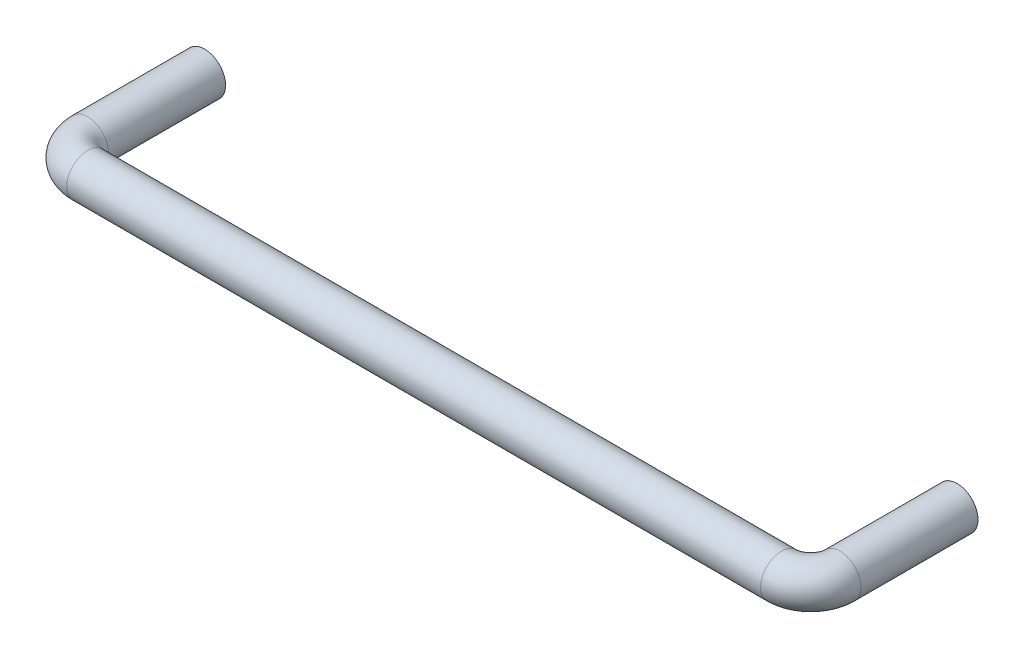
ISO-10303-21;
HEADER;
FILE_DESCRIPTION(('STEP AP214'),'2;1');
FILE_NAME('part.step','',(''),(''),'','','');
FILE_SCHEMA(('AUTOMOTIVE_DESIGN { 1 0 10303 214 1 1 1 1 }'));
ENDSEC;
DATA;
#1=APPLICATION_CONTEXT('core data for automotive mechanical design processes');
#2=APPLICATION_PROTOCOL_DEFINITION('international standard','automotive_design',2000,#1);
#3=PRODUCT_CONTEXT('',#1,'mechanical');
#4=PRODUCT('Part','Part','',(#3));
#5=PRODUCT_RELATED_PRODUCT_CATEGORY('part','',(#4));
#6=PRODUCT_DEFINITION_FORMATION('','',#4);
#7=PRODUCT_DEFINITION_CONTEXT('part definition',#1,'design');
#8=PRODUCT_DEFINITION('design','',#6,#7);
#9=PRODUCT_DEFINITION_SHAPE('','',#8);
#10=(LENGTH_UNIT() NAMED_UNIT(*) SI_UNIT(.MILLI.,.METRE.));
#11=(NAMED_UNIT(*) PLANE_ANGLE_UNIT() SI_UNIT($,.RADIAN.));
#12=(NAMED_UNIT(*) SI_UNIT($,.STERADIAN.) SOLID_ANGLE_UNIT());
#13=UNCERTAINTY_MEASURE_WITH_UNIT(LENGTH_MEASURE(1.E-05),#10,'distance_accuracy_value','');
#14=(GEOMETRIC_REPRESENTATION_CONTEXT(3) GLOBAL_UNCERTAINTY_ASSIGNED_CONTEXT((#13)) GLOBAL_UNIT_ASSIGNED_CONTEXT((#10,
#11,#12)) REPRESENTATION_CONTEXT('',''));
#15=CARTESIAN_POINT('',(0.,0.,0.));
#16=DIRECTION('',(0.,0.,1.));
#17=DIRECTION('',(1.,0.,0.));
#18=AXIS2_PLACEMENT_3D('',#15,#16,#17);
#19=CARTESIAN_POINT('',(-2.53,2.538705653,10.));
#20=DIRECTION('',(0.,0.,-1.));
#21=DIRECTION('',(1.,0.,0.));
#22=AXIS2_PLACEMENT_3D('',#19,#20,#21);
#23=PLANE('',#22);
#24=CARTESIAN_POINT('',(0.,0.,10.));
#25=DIRECTION('',(0.,0.,-1.));
#26=DIRECTION('',(0.,1.,0.));
#27=AXIS2_PLACEMENT_3D('',#24,#25,#26);
#28=CIRCLE('',#27,2.5);
#29=CARTESIAN_POINT('',(0.,2.5,10.));
#30=VERTEX_POINT('',#29);
#31=EDGE_CURVE('E33',#30,#30,#28,.T.);
#32=ORIENTED_EDGE('',*,*,#31,.T.);
#33=EDGE_LOOP('',(#32));
#34=FACE_BOUND('',#33,.T.);
#35=ADVANCED_FACE('F12',(#34),#23,.T.);
#36=CARTESIAN_POINT('',(0.,0.,10.));
#37=DIRECTION('',(0.,0.,-1.));
#38=DIRECTION('',(0.,1.,0.));
#39=AXIS2_PLACEMENT_3D('',#36,#37,#38);
#40=CYLINDRICAL_SURFACE('',#39,2.5);
#41=CARTESIAN_POINT('',(0.,0.,0.450000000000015));
#42=DIRECTION('',(0.,0.,1.));
#43=DIRECTION('',(1.,0.,0.));
#44=AXIS2_PLACEMENT_3D('',#41,#42,#43);
#45=CIRCLE('',#44,2.5);
#46=CARTESIAN_POINT('',(2.5,0.,0.450000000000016));
#47=VERTEX_POINT('',#46);
#48=EDGE_CURVE('E19',#47,#47,#45,.F.);
#49=ORIENTED_EDGE('',*,*,#48,.T.);
#50=EDGE_LOOP('',(#49));
#51=FACE_BOUND('',#50,.T.);
#52=ORIENTED_EDGE('',*,*,#31,.F.);
#53=EDGE_LOOP('',(#52));
#54=FACE_BOUND('',#53,.T.);
#55=ADVANCED_FACE('F77',(#51,#54),#40,.F.);
#56=CARTESIAN_POINT('',(-5.077411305,5.06,0.));
#57=DIRECTION('',(0.,0.,1.));
#58=DIRECTION('',(0.,-1.,0.));
#59=AXIS2_PLACEMENT_3D('',#56,#57,#58);
#60=PLANE('',#59);
#61=CARTESIAN_POINT('',(0.,0.,0.));
#62=DIRECTION('',(0.,0.,1.));
#63=DIRECTION('',(1.,0.,0.));
#64=AXIS2_PLACEMENT_3D('',#61,#62,#63);
#65=CIRCLE('',#64,2.95);
#66=CARTESIAN_POINT('',(2.95,0.,0.));
#67=VERTEX_POINT('',#66);
#68=EDGE_CURVE('E8',#67,#67,#65,.T.);
#69=ORIENTED_EDGE('',*,*,#68,.T.);
#70=EDGE_LOOP('',(#69));
#71=FACE_BOUND('',#70,.T.);
#72=CARTESIAN_POINT('',(0.,0.,0.));
#73=DIRECTION('',(0.,0.,-1.));
#74=DIRECTION('',(1.,0.,0.));
#75=AXIS2_PLACEMENT_3D('',#72,#73,#74);
#76=CIRCLE('',#75,5.);
#77=CARTESIAN_POINT('',(4.99999999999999,0.,0.));
#78=VERTEX_POINT('',#77);
#79=EDGE_CURVE('E36',#78,#78,#76,.F.);
#80=ORIENTED_EDGE('',*,*,#79,.F.);
#81=EDGE_LOOP('',(#80));
#82=FACE_BOUND('',#81,.T.);
#83=ADVANCED_FACE('F66',(#71,#82),#60,.F.);
#84=CARTESIAN_POINT('',(0.,0.,28.));
#85=DIRECTION('',(0.,0.,-1.));
#86=DIRECTION('',(1.,0.,0.));
#87=AXIS2_PLACEMENT_3D('',#84,#85,#86);
#88=CYLINDRICAL_SURFACE('',#87,5.);
#89=ORIENTED_EDGE('',*,*,#79,.T.);
#90=EDGE_LOOP('',(#89));
#91=FACE_BOUND('',#90,.T.);
#92=CARTESIAN_POINT('',(0.,0.,28.));
#93=DIRECTION('',(0.,0.,1.));
#94=DIRECTION('',(0.,-1.,0.));
#95=AXIS2_PLACEMENT_3D('',#92,#93,#94);
#96=CIRCLE('',#95,5.);
#97=CARTESIAN_POINT('',(0.,-5.,28.));
#98=VERTEX_POINT('',#97);
#99=EDGE_CURVE('E39',#98,#98,#96,.T.);
#100=ORIENTED_EDGE('',*,*,#99,.F.);
#101=EDGE_LOOP('',(#100));
#102=FACE_BOUND('',#101,.T.);
#103=ADVANCED_FACE('F64',(#91,#102),#88,.T.);
#104=CARTESIAN_POINT('',(7.,0.,28.));
#105=DIRECTION('',(0.,1.,0.));
#106=DIRECTION('',(-1.,0.,0.));
#107=AXIS2_PLACEMENT_3D('',#104,#105,#106);
#108=TOROIDAL_SURFACE('',#107,7.,5.);
#109=ORIENTED_EDGE('',*,*,#99,.T.);
#110=EDGE_LOOP('',(#109));
#111=FACE_BOUND('',#110,.T.);
#112=CARTESIAN_POINT('',(7.,0.,35.));
#113=DIRECTION('',(1.,0.,0.));
#114=DIRECTION('',(0.,1.,0.));
#115=AXIS2_PLACEMENT_3D('',#112,#113,#114);
#116=CIRCLE('',#115,5.);
#117=CARTESIAN_POINT('',(7.,5.,35.));
#118=VERTEX_POINT('',#117);
#119=EDGE_CURVE('E46',#118,#118,#116,.T.);
#120=ORIENTED_EDGE('',*,*,#119,.F.);
#121=EDGE_LOOP('',(#120));
#122=FACE_BOUND('',#121,.T.);
#123=ADVANCED_FACE('F61',(#111,#122),#108,.T.);
#124=CARTESIAN_POINT('',(7.,0.,35.));
#125=DIRECTION('',(1.,0.,0.));
#126=DIRECTION('',(0.,1.,0.));
#127=AXIS2_PLACEMENT_3D('',#124,#125,#126);
#128=CYLINDRICAL_SURFACE('',#127,5.);
#129=ORIENTED_EDGE('',*,*,#119,.T.);
#130=EDGE_LOOP('',(#129));
#131=FACE_BOUND('',#130,.T.);
#132=CARTESIAN_POINT('',(173.,0.,35.));
#133=DIRECTION('',(1.,0.,0.));
#134=DIRECTION('',(0.,1.,0.));
#135=AXIS2_PLACEMENT_3D('',#132,#133,#134);
#136=CIRCLE('',#135,5.);
#137=CARTESIAN_POINT('',(173.,5.,35.));
#138=VERTEX_POINT('',#137);
#139=EDGE_CURVE('E49',#138,#138,#136,.T.);
#140=ORIENTED_EDGE('',*,*,#139,.F.);
#141=EDGE_LOOP('',(#140));
#142=FACE_BOUND('',#141,.T.);
#143=ADVANCED_FACE('F75',(#131,#142),#128,.T.);
#144=CARTESIAN_POINT('',(173.,0.,28.));
#145=DIRECTION('',(0.,1.,0.));
#146=DIRECTION('',(-1.,0.,0.));
#147=AXIS2_PLACEMENT_3D('',#144,#145,#146);
#148=TOROIDAL_SURFACE('',#147,7.,5.);
#149=ORIENTED_EDGE('',*,*,#139,.T.);
#150=EDGE_LOOP('',(#149));
#151=FACE_BOUND('',#150,.T.);
#152=CARTESIAN_POINT('',(180.,0.,28.));
#153=DIRECTION('',(0.,0.,-1.));
#154=DIRECTION('',(0.,1.,0.));
#155=AXIS2_PLACEMENT_3D('',#152,#153,#154);
#156=CIRCLE('',#155,5.);
#157=CARTESIAN_POINT('',(180.,5.,28.));
#158=VERTEX_POINT('',#157);
#159=EDGE_CURVE('E43',#158,#158,#156,.T.);
#160=ORIENTED_EDGE('',*,*,#159,.F.);
#161=EDGE_LOOP('',(#160));
#162=FACE_BOUND('',#161,.T.);
#163=ADVANCED_FACE('F103',(#151,#162),#148,.T.);
#164=CARTESIAN_POINT('',(180.,0.,28.));
#165=DIRECTION('',(0.,0.,-1.));
#166=DIRECTION('',(1.,0.,0.));
#167=AXIS2_PLACEMENT_3D('',#164,#165,#166);
#168=CYLINDRICAL_SURFACE('',#167,5.);
#169=ORIENTED_EDGE('',*,*,#159,.T.);
#170=EDGE_LOOP('',(#169));
#171=FACE_BOUND('',#170,.T.);
#172=CARTESIAN_POINT('',(180.,0.,0.));
#173=DIRECTION('',(0.,0.,-1.));
#174=DIRECTION('',(1.,0.,0.));
#175=AXIS2_PLACEMENT_3D('',#172,#173,#174);
#176=CIRCLE('',#175,5.);
#177=CARTESIAN_POINT('',(185.,0.,0.));
#178=VERTEX_POINT('',#177);
#179=EDGE_CURVE('E40',#178,#178,#176,.T.);
#180=ORIENTED_EDGE('',*,*,#179,.F.);
#181=EDGE_LOOP('',(#180));
#182=FACE_BOUND('',#181,.T.);
#183=ADVANCED_FACE('F99',(#171,#182),#168,.T.);
#184=CARTESIAN_POINT('',(185.077411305,5.06,0.));
#185=DIRECTION('',(0.,0.,-1.));
#186=DIRECTION('',(0.,-1.,0.));
#187=AXIS2_PLACEMENT_3D('',#184,#185,#186);
#188=PLANE('',#187);
#189=CARTESIAN_POINT('',(180.,0.,0.));
#190=DIRECTION('',(0.,0.,-1.));
#191=DIRECTION('',(-1.,0.,0.));
#192=AXIS2_PLACEMENT_3D('',#189,#190,#191);
#193=CIRCLE('',#192,2.95);
#194=CARTESIAN_POINT('',(177.05,0.,0.));
#195=VERTEX_POINT('',#194);
#196=EDGE_CURVE('E27',#195,#195,#193,.F.);
#197=ORIENTED_EDGE('',*,*,#196,.T.);
#198=EDGE_LOOP('',(#197));
#199=FACE_BOUND('',#198,.T.);
#200=ORIENTED_EDGE('',*,*,#179,.T.);
#201=EDGE_LOOP('',(#200));
#202=FACE_BOUND('',#201,.T.);
#203=ADVANCED_FACE('F93',(#199,#202),#188,.T.);
#204=CARTESIAN_POINT('',(182.53,2.538705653,10.));
#205=DIRECTION('',(0.,0.,1.));
#206=DIRECTION('',(-1.,0.,0.));
#207=AXIS2_PLACEMENT_3D('',#204,#205,#206);
#208=PLANE('',#207);
#209=CARTESIAN_POINT('',(180.,0.,10.));
#210=DIRECTION('',(0.,0.,-1.));
#211=DIRECTION('',(0.,1.,0.));
#212=AXIS2_PLACEMENT_3D('',#209,#210,#211);
#213=CIRCLE('',#212,2.5);
#214=CARTESIAN_POINT('',(180.,2.5,10.));
#215=VERTEX_POINT('',#214);
#216=EDGE_CURVE('E32',#215,#215,#213,.T.);
#217=ORIENTED_EDGE('',*,*,#216,.T.);
#218=EDGE_LOOP('',(#217));
#219=FACE_BOUND('',#218,.T.);
#220=ADVANCED_FACE('F84',(#219),#208,.F.);
#221=CARTESIAN_POINT('',(180.,0.,10.));
#222=DIRECTION('',(0.,0.,-1.));
#223=DIRECTION('',(0.,1.,0.));
#224=AXIS2_PLACEMENT_3D('',#221,#222,#223);
#225=CYLINDRICAL_SURFACE('',#224,2.5);
#226=CARTESIAN_POINT('',(180.,0.,0.450000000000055));
#227=DIRECTION('',(0.,0.,-1.));
#228=DIRECTION('',(-1.,0.,0.));
#229=AXIS2_PLACEMENT_3D('',#226,#227,#228);
#230=CIRCLE('',#229,2.5);
#231=CARTESIAN_POINT('',(177.5,0.,0.450000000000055));
#232=VERTEX_POINT('',#231);
#233=EDGE_CURVE('E23',#232,#232,#230,.T.);
#234=ORIENTED_EDGE('',*,*,#233,.T.);
#235=EDGE_LOOP('',(#234));
#236=FACE_BOUND('',#235,.T.);
#237=ORIENTED_EDGE('',*,*,#216,.F.);
#238=EDGE_LOOP('',(#237));
#239=FACE_BOUND('',#238,.T.);
#240=ADVANCED_FACE('F81',(#236,#239),#225,.F.);
#241=CARTESIAN_POINT('',(180.,0.,0.));
#242=DIRECTION('',(0.,0.,-1.));
#243=DIRECTION('',(-1.,0.,0.));
#244=AXIS2_PLACEMENT_3D('',#241,#242,#243);
#245=CONICAL_SURFACE('',#244,2.95,0.785398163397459);
#246=ORIENTED_EDGE('',*,*,#233,.F.);
#247=EDGE_LOOP('',(#246));
#248=FACE_BOUND('',#247,.T.);
#249=ORIENTED_EDGE('',*,*,#196,.F.);
#250=EDGE_LOOP('',(#249));
#251=FACE_BOUND('',#250,.T.);
#252=ADVANCED_FACE('F83',(#248,#251),#245,.F.);
#253=CARTESIAN_POINT('',(0.,0.,0.450000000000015));
#254=DIRECTION('',(0.,0.,-1.));
#255=DIRECTION('',(-1.,0.,0.));
#256=AXIS2_PLACEMENT_3D('',#253,#254,#255);
#257=CONICAL_SURFACE('',#256,2.5,0.78539816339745);
#258=ORIENTED_EDGE('',*,*,#68,.F.);
#259=EDGE_LOOP('',(#258));
#260=FACE_BOUND('',#259,.T.);
#261=ORIENTED_EDGE('',*,*,#48,.F.);
#262=EDGE_LOOP('',(#261));
#263=FACE_BOUND('',#262,.T.);
#264=ADVANCED_FACE('F14',(#260,#263),#257,.F.);
#265=CLOSED_SHELL('',(#35,#55,#83,#103,#123,#143,#163,#183,#203,#220,#240,#252,#264));
#266=MANIFOLD_SOLID_BREP('B1',#265);
#267=ADVANCED_BREP_SHAPE_REPRESENTATION('',(#18,#266),#14);
#268=SHAPE_DEFINITION_REPRESENTATION(#9,#267);
ENDSEC;
END-ISO-10303-21;
